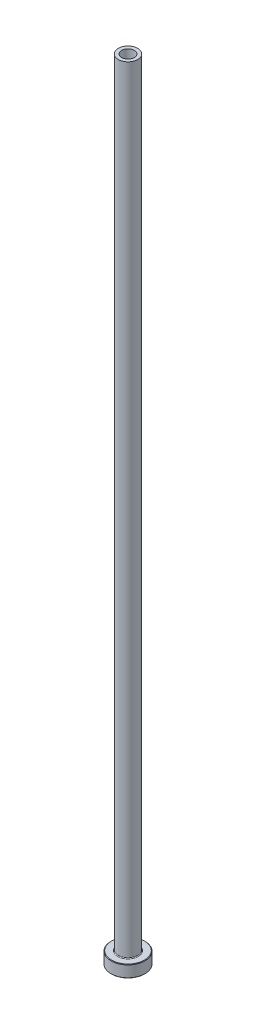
ISO-10303-21;
HEADER;
FILE_DESCRIPTION(('STEP AP214'),'2;1');
FILE_NAME('part.step','',(''),(''),'','','');
FILE_SCHEMA(('AUTOMOTIVE_DESIGN { 1 0 10303 214 1 1 1 1 }'));
ENDSEC;
DATA;
#1=APPLICATION_CONTEXT('core data for automotive mechanical design processes');
#2=APPLICATION_PROTOCOL_DEFINITION('international standard','automotive_design',2000,#1);
#3=PRODUCT_CONTEXT('',#1,'mechanical');
#4=PRODUCT('Part','Part','',(#3));
#5=PRODUCT_RELATED_PRODUCT_CATEGORY('part','',(#4));
#6=PRODUCT_DEFINITION_FORMATION('','',#4);
#7=PRODUCT_DEFINITION_CONTEXT('part definition',#1,'design');
#8=PRODUCT_DEFINITION('design','',#6,#7);
#9=PRODUCT_DEFINITION_SHAPE('','',#8);
#10=(LENGTH_UNIT() NAMED_UNIT(*) SI_UNIT(.MILLI.,.METRE.));
#11=(NAMED_UNIT(*) PLANE_ANGLE_UNIT() SI_UNIT($,.RADIAN.));
#12=(NAMED_UNIT(*) SI_UNIT($,.STERADIAN.) SOLID_ANGLE_UNIT());
#13=UNCERTAINTY_MEASURE_WITH_UNIT(LENGTH_MEASURE(1.E-05),#10,'distance_accuracy_value','');
#14=(GEOMETRIC_REPRESENTATION_CONTEXT(3) GLOBAL_UNCERTAINTY_ASSIGNED_CONTEXT((#13)) GLOBAL_UNIT_ASSIGNED_CONTEXT((#10,
#11,#12)) REPRESENTATION_CONTEXT('',''));
#15=CARTESIAN_POINT('',(0.,0.,0.));
#16=DIRECTION('',(0.,0.,1.));
#17=DIRECTION('',(1.,0.,0.));
#18=AXIS2_PLACEMENT_3D('',#15,#16,#17);
#19=CARTESIAN_POINT('',(0.,92.1876809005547,0.));
#20=DIRECTION('',(0.,1.,0.));
#21=DIRECTION('',(0.,0.,1.));
#22=AXIS2_PLACEMENT_3D('',#19,#20,#21);
#23=CYLINDRICAL_SURFACE('',#22,2.60000000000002);
#24=CARTESIAN_POINT('',(0.,325.,0.));
#25=DIRECTION('',(0.,1.,0.));
#26=DIRECTION('',(0.,0.,1.));
#27=AXIS2_PLACEMENT_3D('',#24,#25,#26);
#28=CIRCLE('',#27,2.60000000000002);
#29=CARTESIAN_POINT('',(0.,325.,2.60000000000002));
#30=VERTEX_POINT('',#29);
#31=EDGE_CURVE('E62',#30,#30,#28,.T.);
#32=ORIENTED_EDGE('',*,*,#31,.T.);
#33=EDGE_LOOP('',(#32));
#34=FACE_BOUND('',#33,.T.);
#35=CARTESIAN_POINT('',(0.,280.,0.));
#36=DIRECTION('',(0.,1.,0.));
#37=DIRECTION('',(0.,0.,1.));
#38=AXIS2_PLACEMENT_3D('',#35,#36,#37);
#39=CIRCLE('',#38,2.60000000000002);
#40=CARTESIAN_POINT('',(0.,280.,2.60000000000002));
#41=VERTEX_POINT('',#40);
#42=EDGE_CURVE('E71',#41,#41,#39,.T.);
#43=ORIENTED_EDGE('',*,*,#42,.F.);
#44=EDGE_LOOP('',(#43));
#45=FACE_BOUND('',#44,.T.);
#46=ADVANCED_FACE('F30',(#34,#45),#23,.F.);
#47=CARTESIAN_POINT('',(-2.60000000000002,325.,0.));
#48=DIRECTION('',(0.,1.,0.));
#49=DIRECTION('',(0.,0.,1.));
#50=AXIS2_PLACEMENT_3D('',#47,#48,#49);
#51=PLANE('',#50);
#52=CARTESIAN_POINT('',(0.,325.,0.));
#53=DIRECTION('',(0.,1.,0.));
#54=DIRECTION('',(0.,0.,1.));
#55=AXIS2_PLACEMENT_3D('',#52,#53,#54);
#56=CIRCLE('',#55,4.00000000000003);
#57=CARTESIAN_POINT('',(0.,325.,4.00000000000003));
#58=VERTEX_POINT('',#57);
#59=EDGE_CURVE('E65',#58,#58,#56,.T.);
#60=ORIENTED_EDGE('',*,*,#59,.T.);
#61=EDGE_LOOP('',(#60));
#62=FACE_BOUND('',#61,.T.);
#63=ORIENTED_EDGE('',*,*,#31,.F.);
#64=EDGE_LOOP('',(#63));
#65=FACE_BOUND('',#64,.T.);
#66=ADVANCED_FACE('F79',(#62,#65),#51,.T.);
#67=CARTESIAN_POINT('',(0.,92.1876809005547,0.));
#68=DIRECTION('',(0.,1.,0.));
#69=DIRECTION('',(0.,0.,1.));
#70=AXIS2_PLACEMENT_3D('',#67,#68,#69);
#71=CYLINDRICAL_SURFACE('',#70,4.00000000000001);
#72=CARTESIAN_POINT('',(0.,5.3,0.));
#73=DIRECTION('',(0.,1.,0.));
#74=DIRECTION('',(0.,0.,1.));
#75=AXIS2_PLACEMENT_3D('',#72,#73,#74);
#76=CIRCLE('',#75,4.00000000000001);
#77=CARTESIAN_POINT('',(0.,5.3,4.00000000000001));
#78=VERTEX_POINT('',#77);
#79=EDGE_CURVE('E59',#78,#78,#76,.T.);
#80=ORIENTED_EDGE('',*,*,#79,.T.);
#81=EDGE_LOOP('',(#80));
#82=FACE_BOUND('',#81,.T.);
#83=ORIENTED_EDGE('',*,*,#59,.F.);
#84=EDGE_LOOP('',(#83));
#85=FACE_BOUND('',#84,.T.);
#86=ADVANCED_FACE('F85',(#82,#85),#71,.T.);
#87=CARTESIAN_POINT('',(-3.99999999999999,5.,0.));
#88=DIRECTION('',(0.,1.,0.));
#89=DIRECTION('',(0.,0.,1.));
#90=AXIS2_PLACEMENT_3D('',#87,#88,#89);
#91=PLANE('',#90);
#92=CARTESIAN_POINT('',(0.,5.,0.));
#93=DIRECTION('',(0.,1.,0.));
#94=DIRECTION('',(0.,0.,1.));
#95=AXIS2_PLACEMENT_3D('',#92,#93,#94);
#96=CIRCLE('',#95,6.79999999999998);
#97=CARTESIAN_POINT('',(0.,5.,6.79999999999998));
#98=VERTEX_POINT('',#97);
#99=EDGE_CURVE('E53',#98,#98,#96,.T.);
#100=ORIENTED_EDGE('',*,*,#99,.T.);
#101=EDGE_LOOP('',(#100));
#102=FACE_BOUND('',#101,.T.);
#103=CARTESIAN_POINT('',(0.,5.,0.));
#104=DIRECTION('',(0.,1.,0.));
#105=DIRECTION('',(0.,0.,1.));
#106=AXIS2_PLACEMENT_3D('',#103,#104,#105);
#107=CIRCLE('',#106,4.30000000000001);
#108=CARTESIAN_POINT('',(0.,5.,4.30000000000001));
#109=VERTEX_POINT('',#108);
#110=EDGE_CURVE('E56',#109,#109,#107,.F.);
#111=ORIENTED_EDGE('',*,*,#110,.T.);
#112=EDGE_LOOP('',(#111));
#113=FACE_BOUND('',#112,.T.);
#114=ADVANCED_FACE('F111',(#102,#113),#91,.T.);
#115=CARTESIAN_POINT('',(0.,92.1876809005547,0.));
#116=DIRECTION('',(0.,1.,0.));
#117=DIRECTION('',(0.,0.,1.));
#118=AXIS2_PLACEMENT_3D('',#115,#116,#117);
#119=CYLINDRICAL_SURFACE('',#118,6.99999999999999);
#120=CARTESIAN_POINT('',(0.,4.8,0.));
#121=DIRECTION('',(0.,1.,0.));
#122=DIRECTION('',(0.,0.,1.));
#123=AXIS2_PLACEMENT_3D('',#120,#121,#122);
#124=CIRCLE('',#123,6.99999999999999);
#125=CARTESIAN_POINT('',(0.,4.8,6.99999999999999));
#126=VERTEX_POINT('',#125);
#127=EDGE_CURVE('E45',#126,#126,#124,.F.);
#128=ORIENTED_EDGE('',*,*,#127,.T.);
#129=EDGE_LOOP('',(#128));
#130=FACE_BOUND('',#129,.T.);
#131=CARTESIAN_POINT('',(0.,0.200000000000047,0.));
#132=DIRECTION('',(0.,-1.,0.));
#133=DIRECTION('',(0.,0.,-1.));
#134=AXIS2_PLACEMENT_3D('',#131,#132,#133);
#135=CIRCLE('',#134,6.99999999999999);
#136=CARTESIAN_POINT('',(0.,0.200000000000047,-6.99999999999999));
#137=VERTEX_POINT('',#136);
#138=EDGE_CURVE('E50',#137,#137,#135,.F.);
#139=ORIENTED_EDGE('',*,*,#138,.T.);
#140=EDGE_LOOP('',(#139));
#141=FACE_BOUND('',#140,.T.);
#142=ADVANCED_FACE('F108',(#130,#141),#119,.T.);
#143=CARTESIAN_POINT('',(-6.99999999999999,0.,0.));
#144=DIRECTION('',(0.,-1.,0.));
#145=DIRECTION('',(0.,0.,-1.));
#146=AXIS2_PLACEMENT_3D('',#143,#144,#145);
#147=PLANE('',#146);
#148=CARTESIAN_POINT('',(0.,0.,0.));
#149=DIRECTION('',(0.,-1.,0.));
#150=DIRECTION('',(0.,0.,-1.));
#151=AXIS2_PLACEMENT_3D('',#148,#149,#150);
#152=CIRCLE('',#151,3.35000000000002);
#153=CARTESIAN_POINT('',(0.,0.,-3.35000000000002));
#154=VERTEX_POINT('',#153);
#155=EDGE_CURVE('E37',#154,#154,#152,.F.);
#156=ORIENTED_EDGE('',*,*,#155,.T.);
#157=EDGE_LOOP('',(#156));
#158=FACE_BOUND('',#157,.T.);
#159=CARTESIAN_POINT('',(0.,0.,0.));
#160=DIRECTION('',(0.,-1.,0.));
#161=DIRECTION('',(0.,0.,-1.));
#162=AXIS2_PLACEMENT_3D('',#159,#160,#161);
#163=CIRCLE('',#162,6.79999999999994);
#164=CARTESIAN_POINT('',(0.,0.,-6.79999999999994));
#165=VERTEX_POINT('',#164);
#166=EDGE_CURVE('E41',#165,#165,#163,.T.);
#167=ORIENTED_EDGE('',*,*,#166,.T.);
#168=EDGE_LOOP('',(#167));
#169=FACE_BOUND('',#168,.T.);
#170=ADVANCED_FACE('F110',(#158,#169),#147,.T.);
#171=CARTESIAN_POINT('',(0.,92.1876809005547,0.));
#172=DIRECTION('',(0.,1.,0.));
#173=DIRECTION('',(0.,0.,1.));
#174=AXIS2_PLACEMENT_3D('',#171,#172,#173);
#175=CYLINDRICAL_SURFACE('',#174,2.85000000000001);
#176=CARTESIAN_POINT('',(0.,0.5,0.));
#177=DIRECTION('',(0.,-1.,0.));
#178=DIRECTION('',(0.,0.,-1.));
#179=AXIS2_PLACEMENT_3D('',#176,#177,#178);
#180=CIRCLE('',#179,2.85000000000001);
#181=CARTESIAN_POINT('',(0.,0.5,-2.85000000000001));
#182=VERTEX_POINT('',#181);
#183=EDGE_CURVE('E10',#182,#182,#180,.T.);
#184=ORIENTED_EDGE('',*,*,#183,.T.);
#185=EDGE_LOOP('',(#184));
#186=FACE_BOUND('',#185,.T.);
#187=CARTESIAN_POINT('',(0.,268.,0.));
#188=DIRECTION('',(0.,1.,0.));
#189=DIRECTION('',(0.,0.,1.));
#190=AXIS2_PLACEMENT_3D('',#187,#188,#189);
#191=CIRCLE('',#190,2.85000000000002);
#192=CARTESIAN_POINT('',(0.,268.,2.85000000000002));
#193=VERTEX_POINT('',#192);
#194=EDGE_CURVE('E68',#193,#193,#191,.T.);
#195=ORIENTED_EDGE('',*,*,#194,.T.);
#196=EDGE_LOOP('',(#195));
#197=FACE_BOUND('',#196,.T.);
#198=ADVANCED_FACE('F118',(#186,#197),#175,.F.);
#199=CARTESIAN_POINT('',(0.,268.,0.));
#200=DIRECTION('',(0.,-1.,0.));
#201=DIRECTION('',(0.,0.,-1.));
#202=AXIS2_PLACEMENT_3D('',#199,#200,#201);
#203=CONICAL_SURFACE('',#202,2.85000000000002,0.0208303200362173);
#204=ORIENTED_EDGE('',*,*,#42,.T.);
#205=EDGE_LOOP('',(#204));
#206=FACE_BOUND('',#205,.T.);
#207=ORIENTED_EDGE('',*,*,#194,.F.);
#208=EDGE_LOOP('',(#207));
#209=FACE_BOUND('',#208,.T.);
#210=ADVANCED_FACE('F75',(#206,#209),#203,.F.);
#211=CARTESIAN_POINT('',(0.,5.3,0.));
#212=DIRECTION('',(0.,1.,0.));
#213=DIRECTION('',(0.,0.,1.));
#214=AXIS2_PLACEMENT_3D('',#211,#212,#213);
#215=TOROIDAL_SURFACE('',#214,4.30000000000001,0.3);
#216=ORIENTED_EDGE('',*,*,#110,.F.);
#217=EDGE_LOOP('',(#216));
#218=FACE_BOUND('',#217,.T.);
#219=ORIENTED_EDGE('',*,*,#79,.F.);
#220=EDGE_LOOP('',(#219));
#221=FACE_BOUND('',#220,.T.);
#222=ADVANCED_FACE('F90',(#218,#221),#215,.F.);
#223=CARTESIAN_POINT('',(0.,5.,0.));
#224=DIRECTION('',(0.,-1.,0.));
#225=DIRECTION('',(0.,0.,-1.));
#226=AXIS2_PLACEMENT_3D('',#223,#224,#225);
#227=CONICAL_SURFACE('',#226,6.79999999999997,0.785398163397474);
#228=ORIENTED_EDGE('',*,*,#127,.F.);
#229=EDGE_LOOP('',(#228));
#230=FACE_BOUND('',#229,.T.);
#231=ORIENTED_EDGE('',*,*,#99,.F.);
#232=EDGE_LOOP('',(#231));
#233=FACE_BOUND('',#232,.T.);
#234=ADVANCED_FACE('F93',(#230,#233),#227,.T.);
#235=CARTESIAN_POINT('',(0.,0.200000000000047,0.));
#236=DIRECTION('',(0.,1.,0.));
#237=DIRECTION('',(0.,0.,1.));
#238=AXIS2_PLACEMENT_3D('',#235,#236,#237);
#239=CONICAL_SURFACE('',#238,6.99999999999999,0.78539816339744);
#240=ORIENTED_EDGE('',*,*,#166,.F.);
#241=EDGE_LOOP('',(#240));
#242=FACE_BOUND('',#241,.T.);
#243=ORIENTED_EDGE('',*,*,#138,.F.);
#244=EDGE_LOOP('',(#243));
#245=FACE_BOUND('',#244,.T.);
#246=ADVANCED_FACE('F96',(#242,#245),#239,.T.);
#247=CARTESIAN_POINT('',(0.,0.,0.));
#248=DIRECTION('',(0.,-1.,0.));
#249=DIRECTION('',(0.,0.,-1.));
#250=AXIS2_PLACEMENT_3D('',#247,#248,#249);
#251=CONICAL_SURFACE('',#250,3.35000000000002,0.785398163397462);
#252=ORIENTED_EDGE('',*,*,#183,.F.);
#253=EDGE_LOOP('',(#252));
#254=FACE_BOUND('',#253,.T.);
#255=ORIENTED_EDGE('',*,*,#155,.F.);
#256=EDGE_LOOP('',(#255));
#257=FACE_BOUND('',#256,.T.);
#258=ADVANCED_FACE('F32',(#254,#257),#251,.F.);
#259=CLOSED_SHELL('',(#46,#66,#86,#114,#142,#170,#198,#210,#222,#234,#246,#258));
#260=MANIFOLD_SOLID_BREP('B2',#259);
#261=ADVANCED_BREP_SHAPE_REPRESENTATION('',(#18,#260),#14);
#262=SHAPE_DEFINITION_REPRESENTATION(#9,#261);
ENDSEC;
END-ISO-10303-21;
